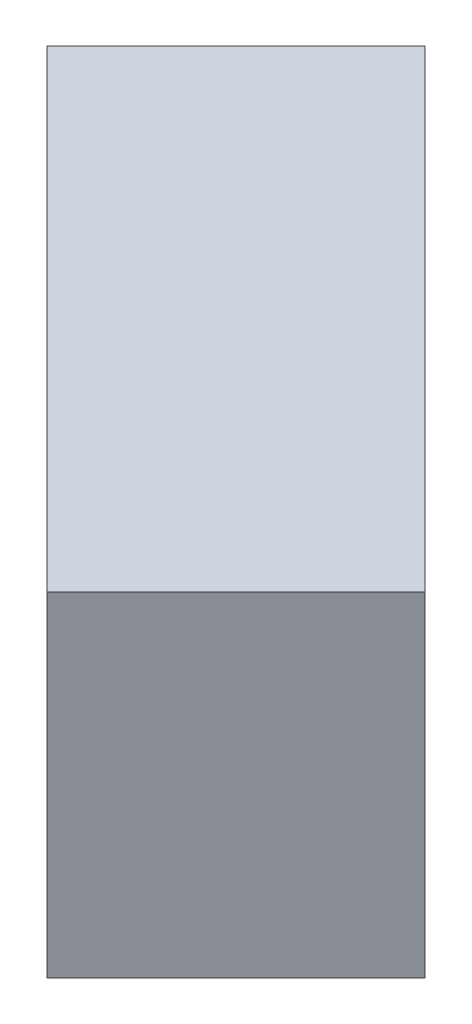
ISO-10303-21;
HEADER;
FILE_DESCRIPTION(('STEP AP214'),'2;1');
FILE_NAME('part.step','',(''),(''),'','','');
FILE_SCHEMA(('AUTOMOTIVE_DESIGN { 1 0 10303 214 1 1 1 1 }'));
ENDSEC;
DATA;
#1=APPLICATION_CONTEXT('core data for automotive mechanical design processes');
#2=APPLICATION_PROTOCOL_DEFINITION('international standard','automotive_design',2000,#1);
#3=PRODUCT_CONTEXT('',#1,'mechanical');
#4=PRODUCT('Part','Part','',(#3));
#5=PRODUCT_RELATED_PRODUCT_CATEGORY('part','',(#4));
#6=PRODUCT_DEFINITION_FORMATION('','',#4);
#7=PRODUCT_DEFINITION_CONTEXT('part definition',#1,'design');
#8=PRODUCT_DEFINITION('design','',#6,#7);
#9=PRODUCT_DEFINITION_SHAPE('','',#8);
#10=(LENGTH_UNIT() NAMED_UNIT(*) SI_UNIT(.MILLI.,.METRE.));
#11=(NAMED_UNIT(*) PLANE_ANGLE_UNIT() SI_UNIT($,.RADIAN.));
#12=(NAMED_UNIT(*) SI_UNIT($,.STERADIAN.) SOLID_ANGLE_UNIT());
#13=UNCERTAINTY_MEASURE_WITH_UNIT(LENGTH_MEASURE(1.E-05),#10,'distance_accuracy_value','');
#14=(GEOMETRIC_REPRESENTATION_CONTEXT(3) GLOBAL_UNCERTAINTY_ASSIGNED_CONTEXT((#13)) GLOBAL_UNIT_ASSIGNED_CONTEXT((#10,
#11,#12)) REPRESENTATION_CONTEXT('',''));
#15=CARTESIAN_POINT('',(0.,0.,0.));
#16=DIRECTION('',(0.,0.,1.));
#17=DIRECTION('',(1.,0.,0.));
#18=AXIS2_PLACEMENT_3D('',#15,#16,#17);
#19=CARTESIAN_POINT('',(-205.060966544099,-200.,134.350288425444));
#20=DIRECTION('',(0.,-1.,0.));
#21=DIRECTION('',(0.,0.,-1.));
#22=AXIS2_PLACEMENT_3D('',#19,#20,#21);
#23=PLANE('',#22);
#24=DIRECTION('',(-0.707106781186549,0.,-0.707106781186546));
#25=VECTOR('',#24,1.);
#26=CARTESIAN_POINT('',(-176.776695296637,-200.,106.066017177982));
#27=LINE('',#26,#25);
#28=CARTESIAN_POINT('',(-106.066017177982,-200.,176.776695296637));
#29=VERTEX_POINT('',#28);
#30=CARTESIAN_POINT('',(-176.776695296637,-200.,106.066017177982));
#31=VERTEX_POINT('',#30);
#32=EDGE_CURVE('E117',#29,#31,#27,.T.);
#33=ORIENTED_EDGE('',*,*,#32,.F.);
#34=DIRECTION('',(0.707106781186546,0.,-0.707106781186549));
#35=VECTOR('',#34,1.);
#36=CARTESIAN_POINT('',(-134.350288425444,-200.,205.060966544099));
#37=LINE('',#36,#35);
#38=CARTESIAN_POINT('',(-134.350288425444,-200.,205.060966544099));
#39=VERTEX_POINT('',#38);
#40=EDGE_CURVE('E11',#39,#29,#37,.T.);
#41=ORIENTED_EDGE('',*,*,#40,.F.);
#42=DIRECTION('',(-0.707106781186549,0.,-0.707106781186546));
#43=VECTOR('',#42,1.);
#44=CARTESIAN_POINT('',(-205.060966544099,-200.,134.350288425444));
#45=LINE('',#44,#43);
#46=CARTESIAN_POINT('',(-205.060966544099,-200.,134.350288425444));
#47=VERTEX_POINT('',#46);
#48=EDGE_CURVE('E107',#39,#47,#45,.T.);
#49=ORIENTED_EDGE('',*,*,#48,.T.);
#50=DIRECTION('',(0.707106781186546,0.,-0.707106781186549));
#51=VECTOR('',#50,1.);
#52=CARTESIAN_POINT('',(-205.060966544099,-200.,134.350288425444));
#53=LINE('',#52,#51);
#54=EDGE_CURVE('E44',#47,#31,#53,.T.);
#55=ORIENTED_EDGE('',*,*,#54,.T.);
#56=EDGE_LOOP('',(#33,#41,#49,#55));
#57=FACE_BOUND('',#56,.T.);
#58=ADVANCED_FACE('F41',(#57),#23,.T.);
#59=CARTESIAN_POINT('',(-134.350288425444,-200.,205.060966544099));
#60=DIRECTION('',(0.707106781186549,0.,0.707106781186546));
#61=DIRECTION('',(0.707106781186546,0.,-0.707106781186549));
#62=AXIS2_PLACEMENT_3D('',#59,#60,#61);
#63=PLANE('',#62);
#64=DIRECTION('',(0.,-1.,0.));
#65=VECTOR('',#64,1.);
#66=CARTESIAN_POINT('',(-106.066017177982,-200.,176.776695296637));
#67=LINE('',#66,#65);
#68=CARTESIAN_POINT('',(-106.066017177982,-150.,176.776695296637));
#69=VERTEX_POINT('',#68);
#70=EDGE_CURVE('E111',#69,#29,#67,.T.);
#71=ORIENTED_EDGE('',*,*,#70,.F.);
#72=DIRECTION('',(0.707106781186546,0.,-0.707106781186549));
#73=VECTOR('',#72,1.);
#74=CARTESIAN_POINT('',(-134.350288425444,-150.,205.060966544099));
#75=LINE('',#74,#73);
#76=CARTESIAN_POINT('',(-134.350288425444,-150.,205.060966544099));
#77=VERTEX_POINT('',#76);
#78=EDGE_CURVE('E51',#77,#69,#75,.T.);
#79=ORIENTED_EDGE('',*,*,#78,.F.);
#80=DIRECTION('',(0.,-1.,0.));
#81=VECTOR('',#80,1.);
#82=CARTESIAN_POINT('',(-134.350288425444,-200.,205.060966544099));
#83=LINE('',#82,#81);
#84=EDGE_CURVE('E103',#77,#39,#83,.T.);
#85=ORIENTED_EDGE('',*,*,#84,.T.);
#86=ORIENTED_EDGE('',*,*,#40,.T.);
#87=EDGE_LOOP('',(#71,#79,#85,#86));
#88=FACE_BOUND('',#87,.T.);
#89=ADVANCED_FACE('F133',(#88),#63,.T.);
#90=CARTESIAN_POINT('',(-205.060966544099,-150.,134.350288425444));
#91=DIRECTION('',(0.,1.,0.));
#92=DIRECTION('',(0.,0.,1.));
#93=AXIS2_PLACEMENT_3D('',#90,#91,#92);
#94=PLANE('',#93);
#95=DIRECTION('',(0.707106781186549,0.,0.707106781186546));
#96=VECTOR('',#95,1.);
#97=CARTESIAN_POINT('',(-176.776695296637,-150.,106.066017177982));
#98=LINE('',#97,#96);
#99=CARTESIAN_POINT('',(-176.776695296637,-150.,106.066017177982));
#100=VERTEX_POINT('',#99);
#101=EDGE_CURVE('E97',#100,#69,#98,.T.);
#102=ORIENTED_EDGE('',*,*,#101,.F.);
#103=DIRECTION('',(0.707106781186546,0.,-0.707106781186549));
#104=VECTOR('',#103,1.);
#105=CARTESIAN_POINT('',(-205.060966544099,-150.,134.350288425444));
#106=LINE('',#105,#104);
#107=CARTESIAN_POINT('',(-205.060966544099,-150.,134.350288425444));
#108=VERTEX_POINT('',#107);
#109=EDGE_CURVE('E92',#108,#100,#106,.T.);
#110=ORIENTED_EDGE('',*,*,#109,.F.);
#111=DIRECTION('',(0.707106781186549,0.,0.707106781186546));
#112=VECTOR('',#111,1.);
#113=CARTESIAN_POINT('',(-205.060966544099,-150.,134.350288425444));
#114=LINE('',#113,#112);
#115=EDGE_CURVE('E95',#108,#77,#114,.T.);
#116=ORIENTED_EDGE('',*,*,#115,.T.);
#117=ORIENTED_EDGE('',*,*,#78,.T.);
#118=EDGE_LOOP('',(#102,#110,#116,#117));
#119=FACE_BOUND('',#118,.T.);
#120=ADVANCED_FACE('F94',(#119),#94,.T.);
#121=CARTESIAN_POINT('',(-205.060966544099,-200.,134.350288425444));
#122=DIRECTION('',(-0.707106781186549,0.,-0.707106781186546));
#123=DIRECTION('',(-0.707106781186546,0.,0.707106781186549));
#124=AXIS2_PLACEMENT_3D('',#121,#122,#123);
#125=PLANE('',#124);
#126=DIRECTION('',(0.,1.,0.));
#127=VECTOR('',#126,1.);
#128=CARTESIAN_POINT('',(-176.776695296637,-200.,106.066017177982));
#129=LINE('',#128,#127);
#130=EDGE_CURVE('E120',#31,#100,#129,.T.);
#131=ORIENTED_EDGE('',*,*,#130,.F.);
#132=ORIENTED_EDGE('',*,*,#54,.F.);
#133=DIRECTION('',(0.,1.,0.));
#134=VECTOR('',#133,1.);
#135=CARTESIAN_POINT('',(-205.060966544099,-200.,134.350288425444));
#136=LINE('',#135,#134);
#137=EDGE_CURVE('E102',#47,#108,#136,.T.);
#138=ORIENTED_EDGE('',*,*,#137,.T.);
#139=ORIENTED_EDGE('',*,*,#109,.T.);
#140=EDGE_LOOP('',(#131,#132,#138,#139));
#141=FACE_BOUND('',#140,.T.);
#142=ADVANCED_FACE('F105',(#141),#125,.T.);
#143=CARTESIAN_POINT('',(-134.350288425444,-200.,205.060966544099));
#144=DIRECTION('',(-0.707106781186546,0.,0.707106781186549));
#145=DIRECTION('',(0.707106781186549,0.,0.707106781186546));
#146=AXIS2_PLACEMENT_3D('',#143,#144,#145);
#147=PLANE('',#146);
#148=CARTESIAN_POINT('',(-194.4543648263,-165.,144.956890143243));
#149=DIRECTION('',(0.707106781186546,0.,-0.707106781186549));
#150=DIRECTION('',(-0.707106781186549,0.,-0.707106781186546));
#151=AXIS2_PLACEMENT_3D('',#148,#149,#150);
#152=CIRCLE('',#151,10.);
#153=CARTESIAN_POINT('',(-201.525432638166,-165.,137.885822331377));
#154=VERTEX_POINT('',#153);
#155=EDGE_CURVE('E121',#154,#154,#152,.T.);
#156=ORIENTED_EDGE('',*,*,#155,.T.);
#157=EDGE_LOOP('',(#156));
#158=FACE_BOUND('',#157,.T.);
#159=ORIENTED_EDGE('',*,*,#48,.F.);
#160=ORIENTED_EDGE('',*,*,#84,.F.);
#161=ORIENTED_EDGE('',*,*,#115,.F.);
#162=ORIENTED_EDGE('',*,*,#137,.F.);
#163=EDGE_LOOP('',(#159,#160,#161,#162));
#164=FACE_BOUND('',#163,.T.);
#165=ADVANCED_FACE('F101',(#158,#164),#147,.T.);
#166=CARTESIAN_POINT('',(-106.066017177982,-200.,176.776695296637));
#167=DIRECTION('',(-0.707106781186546,0.,0.707106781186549));
#168=DIRECTION('',(0.707106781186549,0.,0.707106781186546));
#169=AXIS2_PLACEMENT_3D('',#166,#167,#168);
#170=PLANE('',#169);
#171=CARTESIAN_POINT('',(-166.170093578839,-165.,116.672618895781));
#172=DIRECTION('',(0.707106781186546,0.,-0.707106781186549));
#173=DIRECTION('',(-0.707106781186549,0.,-0.707106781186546));
#174=AXIS2_PLACEMENT_3D('',#171,#172,#173);
#175=CIRCLE('',#174,10.);
#176=CARTESIAN_POINT('',(-173.241161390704,-165.,109.601551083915));
#177=VERTEX_POINT('',#176);
#178=EDGE_CURVE('E163',#177,#177,#175,.T.);
#179=ORIENTED_EDGE('',*,*,#178,.F.);
#180=EDGE_LOOP('',(#179));
#181=FACE_BOUND('',#180,.T.);
#182=ORIENTED_EDGE('',*,*,#32,.T.);
#183=ORIENTED_EDGE('',*,*,#130,.T.);
#184=ORIENTED_EDGE('',*,*,#101,.T.);
#185=ORIENTED_EDGE('',*,*,#70,.T.);
#186=EDGE_LOOP('',(#182,#183,#184,#185));
#187=FACE_BOUND('',#186,.T.);
#188=ADVANCED_FACE('F132',(#181,#187),#170,.F.);
#189=CARTESIAN_POINT('',(-194.4543648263,-165.,144.956890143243));
#190=DIRECTION('',(0.707106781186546,0.,-0.707106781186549));
#191=DIRECTION('',(-0.707106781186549,0.,-0.707106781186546));
#192=AXIS2_PLACEMENT_3D('',#189,#190,#191);
#193=CYLINDRICAL_SURFACE('',#192,10.);
#194=ORIENTED_EDGE('',*,*,#155,.F.);
#195=EDGE_LOOP('',(#194));
#196=FACE_BOUND('',#195,.T.);
#197=ORIENTED_EDGE('',*,*,#178,.T.);
#198=EDGE_LOOP('',(#197));
#199=FACE_BOUND('',#198,.T.);
#200=ADVANCED_FACE('F151',(#196,#199),#193,.F.);
#201=CLOSED_SHELL('',(#58,#89,#120,#142,#165,#188,#200));
#202=MANIFOLD_SOLID_BREP('B2',#201);
#203=ADVANCED_BREP_SHAPE_REPRESENTATION('',(#18,#202),#14);
#204=SHAPE_DEFINITION_REPRESENTATION(#9,#203);
ENDSEC;
END-ISO-10303-21;
